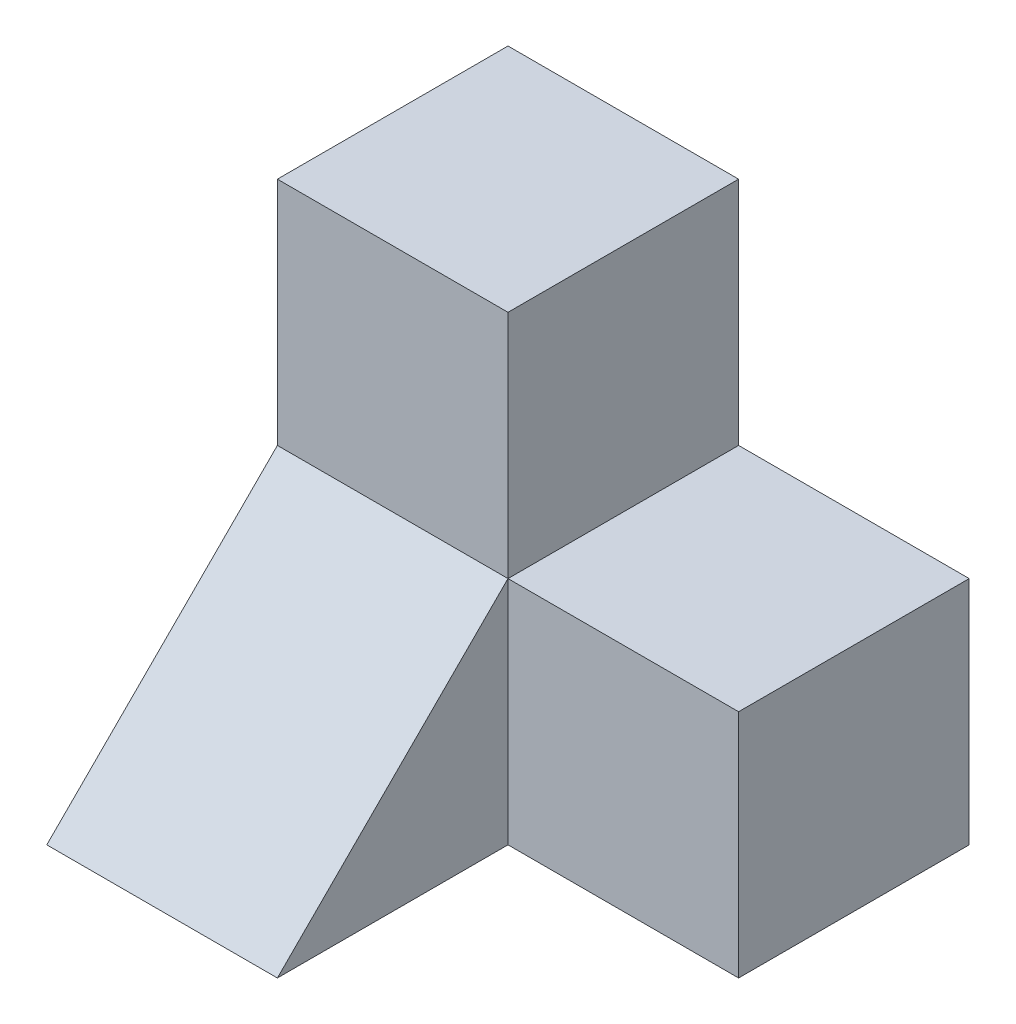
ISO-10303-21;
HEADER;
FILE_DESCRIPTION(('STEP AP214'),'2;1');
FILE_NAME('part.step','',(''),(''),'','','');
FILE_SCHEMA(('AUTOMOTIVE_DESIGN { 1 0 10303 214 1 1 1 1 }'));
ENDSEC;
DATA;
#1=APPLICATION_CONTEXT('core data for automotive mechanical design processes');
#2=APPLICATION_PROTOCOL_DEFINITION('international standard','automotive_design',2000,#1);
#3=PRODUCT_CONTEXT('',#1,'mechanical');
#4=PRODUCT('Part','Part','',(#3));
#5=PRODUCT_RELATED_PRODUCT_CATEGORY('part','',(#4));
#6=PRODUCT_DEFINITION_FORMATION('','',#4);
#7=PRODUCT_DEFINITION_CONTEXT('part definition',#1,'design');
#8=PRODUCT_DEFINITION('design','',#6,#7);
#9=PRODUCT_DEFINITION_SHAPE('','',#8);
#10=(LENGTH_UNIT() NAMED_UNIT(*) SI_UNIT(.MILLI.,.METRE.));
#11=(NAMED_UNIT(*) PLANE_ANGLE_UNIT() SI_UNIT($,.RADIAN.));
#12=(NAMED_UNIT(*) SI_UNIT($,.STERADIAN.) SOLID_ANGLE_UNIT());
#13=UNCERTAINTY_MEASURE_WITH_UNIT(LENGTH_MEASURE(1.E-05),#10,'distance_accuracy_value','');
#14=(GEOMETRIC_REPRESENTATION_CONTEXT(3) GLOBAL_UNCERTAINTY_ASSIGNED_CONTEXT((#13)) GLOBAL_UNIT_ASSIGNED_CONTEXT((#10,
#11,#12)) REPRESENTATION_CONTEXT('',''));
#15=CARTESIAN_POINT('',(0.,0.,0.));
#16=DIRECTION('',(0.,0.,1.));
#17=DIRECTION('',(1.,0.,0.));
#18=AXIS2_PLACEMENT_3D('',#15,#16,#17);
#19=CARTESIAN_POINT('',(0.,0.,10.));
#20=DIRECTION('',(0.,0.,1.));
#21=DIRECTION('',(1.,0.,0.));
#22=AXIS2_PLACEMENT_3D('',#19,#20,#21);
#23=PLANE('',#22);
#24=DIRECTION('',(-1.,0.,0.));
#25=VECTOR('',#24,1.);
#26=CARTESIAN_POINT('',(0.,10.,10.));
#27=LINE('',#26,#25);
#28=CARTESIAN_POINT('',(10.,10.,10.));
#29=VERTEX_POINT('',#28);
#30=CARTESIAN_POINT('',(0.,10.,10.));
#31=VERTEX_POINT('',#30);
#32=EDGE_CURVE('E99',#29,#31,#27,.T.);
#33=ORIENTED_EDGE('',*,*,#32,.F.);
#34=DIRECTION('',(0.,1.,0.));
#35=VECTOR('',#34,1.);
#36=CARTESIAN_POINT('',(10.,10.,10.));
#37=LINE('',#36,#35);
#38=CARTESIAN_POINT('',(10.,20.,10.));
#39=VERTEX_POINT('',#38);
#40=EDGE_CURVE('E139',#29,#39,#37,.T.);
#41=ORIENTED_EDGE('',*,*,#40,.T.);
#42=DIRECTION('',(-1.,0.,0.));
#43=VECTOR('',#42,1.);
#44=CARTESIAN_POINT('',(0.,20.,10.));
#45=LINE('',#44,#43);
#46=CARTESIAN_POINT('',(0.,20.,10.));
#47=VERTEX_POINT('',#46);
#48=EDGE_CURVE('E141',#39,#47,#45,.T.);
#49=ORIENTED_EDGE('',*,*,#48,.T.);
#50=DIRECTION('',(0.,-1.,0.));
#51=VECTOR('',#50,1.);
#52=CARTESIAN_POINT('',(0.,20.,10.));
#53=LINE('',#52,#51);
#54=EDGE_CURVE('E133',#47,#31,#53,.T.);
#55=ORIENTED_EDGE('',*,*,#54,.T.);
#56=EDGE_LOOP('',(#33,#41,#49,#55));
#57=FACE_BOUND('',#56,.T.);
#58=ADVANCED_FACE('F33',(#57),#23,.T.);
#59=CARTESIAN_POINT('',(0.,20.,10.));
#60=DIRECTION('',(1.,0.,0.));
#61=DIRECTION('',(0.,1.,0.));
#62=AXIS2_PLACEMENT_3D('',#59,#60,#61);
#63=PLANE('',#62);
#64=DIRECTION('',(0.,0.,-1.));
#65=VECTOR('',#64,1.);
#66=CARTESIAN_POINT('',(0.,0.,10.));
#67=LINE('',#66,#65);
#68=CARTESIAN_POINT('',(0.,0.,20.));
#69=VERTEX_POINT('',#68);
#70=CARTESIAN_POINT('',(0.,0.,0.));
#71=VERTEX_POINT('',#70);
#72=EDGE_CURVE('E100',#69,#71,#67,.T.);
#73=ORIENTED_EDGE('',*,*,#72,.F.);
#74=DIRECTION('',(0.,-0.707106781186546,0.707106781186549));
#75=VECTOR('',#74,1.);
#76=CARTESIAN_POINT('',(0.,0.,20.));
#77=LINE('',#76,#75);
#78=EDGE_CURVE('E41',#69,#31,#77,.F.);
#79=ORIENTED_EDGE('',*,*,#78,.T.);
#80=ORIENTED_EDGE('',*,*,#54,.F.);
#81=DIRECTION('',(0.,0.,-1.));
#82=VECTOR('',#81,1.);
#83=CARTESIAN_POINT('',(0.,20.,10.));
#84=LINE('',#83,#82);
#85=CARTESIAN_POINT('',(0.,20.,0.));
#86=VERTEX_POINT('',#85);
#87=EDGE_CURVE('E143',#47,#86,#84,.T.);
#88=ORIENTED_EDGE('',*,*,#87,.T.);
#89=DIRECTION('',(0.,-1.,0.));
#90=VECTOR('',#89,1.);
#91=CARTESIAN_POINT('',(0.,20.,0.));
#92=LINE('',#91,#90);
#93=EDGE_CURVE('E107',#86,#71,#92,.T.);
#94=ORIENTED_EDGE('',*,*,#93,.T.);
#95=EDGE_LOOP('',(#73,#79,#80,#88,#94));
#96=FACE_BOUND('',#95,.T.);
#97=ADVANCED_FACE('F104',(#96),#63,.F.);
#98=CARTESIAN_POINT('',(0.,0.,10.));
#99=DIRECTION('',(0.,1.,0.));
#100=DIRECTION('',(0.,0.,1.));
#101=AXIS2_PLACEMENT_3D('',#98,#99,#100);
#102=PLANE('',#101);
#103=DIRECTION('',(1.,0.,0.));
#104=VECTOR('',#103,1.);
#105=CARTESIAN_POINT('',(0.,0.,0.));
#106=LINE('',#105,#104);
#107=CARTESIAN_POINT('',(20.,0.,0.));
#108=VERTEX_POINT('',#107);
#109=EDGE_CURVE('E145',#71,#108,#106,.T.);
#110=ORIENTED_EDGE('',*,*,#109,.T.);
#111=DIRECTION('',(0.,0.,-1.));
#112=VECTOR('',#111,1.);
#113=CARTESIAN_POINT('',(20.,0.,10.));
#114=LINE('',#113,#112);
#115=CARTESIAN_POINT('',(20.,0.,10.));
#116=VERTEX_POINT('',#115);
#117=EDGE_CURVE('E109',#116,#108,#114,.T.);
#118=ORIENTED_EDGE('',*,*,#117,.F.);
#119=DIRECTION('',(1.,0.,0.));
#120=VECTOR('',#119,1.);
#121=CARTESIAN_POINT('',(0.,0.,10.));
#122=LINE('',#121,#120);
#123=CARTESIAN_POINT('',(10.,0.,10.));
#124=VERTEX_POINT('',#123);
#125=EDGE_CURVE('E130',#124,#116,#122,.T.);
#126=ORIENTED_EDGE('',*,*,#125,.F.);
#127=DIRECTION('',(0.,0.,-1.));
#128=VECTOR('',#127,1.);
#129=CARTESIAN_POINT('',(10.,0.,20.));
#130=LINE('',#129,#128);
#131=CARTESIAN_POINT('',(10.,0.,20.));
#132=VERTEX_POINT('',#131);
#133=EDGE_CURVE('E114',#132,#124,#130,.T.);
#134=ORIENTED_EDGE('',*,*,#133,.F.);
#135=DIRECTION('',(1.,0.,0.));
#136=VECTOR('',#135,1.);
#137=CARTESIAN_POINT('',(0.,0.,20.));
#138=LINE('',#137,#136);
#139=EDGE_CURVE('E97',#69,#132,#138,.T.);
#140=ORIENTED_EDGE('',*,*,#139,.F.);
#141=ORIENTED_EDGE('',*,*,#72,.T.);
#142=EDGE_LOOP('',(#110,#118,#126,#134,#140,#141));
#143=FACE_BOUND('',#142,.T.);
#144=ADVANCED_FACE('F112',(#143),#102,.F.);
#145=CARTESIAN_POINT('',(20.,0.,10.));
#146=DIRECTION('',(-1.,0.,0.));
#147=DIRECTION('',(0.,0.,1.));
#148=AXIS2_PLACEMENT_3D('',#145,#146,#147);
#149=PLANE('',#148);
#150=DIRECTION('',(0.,1.,0.));
#151=VECTOR('',#150,1.);
#152=CARTESIAN_POINT('',(20.,0.,0.));
#153=LINE('',#152,#151);
#154=CARTESIAN_POINT('',(20.,10.,0.));
#155=VERTEX_POINT('',#154);
#156=EDGE_CURVE('E147',#108,#155,#153,.T.);
#157=ORIENTED_EDGE('',*,*,#156,.T.);
#158=DIRECTION('',(0.,0.,-1.));
#159=VECTOR('',#158,1.);
#160=CARTESIAN_POINT('',(20.,10.,10.));
#161=LINE('',#160,#159);
#162=CARTESIAN_POINT('',(20.,10.,10.));
#163=VERTEX_POINT('',#162);
#164=EDGE_CURVE('E162',#163,#155,#161,.T.);
#165=ORIENTED_EDGE('',*,*,#164,.F.);
#166=DIRECTION('',(0.,1.,0.));
#167=VECTOR('',#166,1.);
#168=CARTESIAN_POINT('',(20.,0.,10.));
#169=LINE('',#168,#167);
#170=EDGE_CURVE('E132',#116,#163,#169,.T.);
#171=ORIENTED_EDGE('',*,*,#170,.F.);
#172=ORIENTED_EDGE('',*,*,#117,.T.);
#173=EDGE_LOOP('',(#157,#165,#171,#172));
#174=FACE_BOUND('',#173,.T.);
#175=ADVANCED_FACE('F170',(#174),#149,.F.);
#176=CARTESIAN_POINT('',(20.,10.,10.));
#177=DIRECTION('',(0.,-1.,0.));
#178=DIRECTION('',(1.,0.,0.));
#179=AXIS2_PLACEMENT_3D('',#176,#177,#178);
#180=PLANE('',#179);
#181=DIRECTION('',(-1.,0.,0.));
#182=VECTOR('',#181,1.);
#183=CARTESIAN_POINT('',(20.,10.,0.));
#184=LINE('',#183,#182);
#185=CARTESIAN_POINT('',(10.,10.,0.));
#186=VERTEX_POINT('',#185);
#187=EDGE_CURVE('E149',#155,#186,#184,.T.);
#188=ORIENTED_EDGE('',*,*,#187,.T.);
#189=DIRECTION('',(0.,0.,-1.));
#190=VECTOR('',#189,1.);
#191=CARTESIAN_POINT('',(10.,10.,10.));
#192=LINE('',#191,#190);
#193=EDGE_CURVE('E159',#29,#186,#192,.T.);
#194=ORIENTED_EDGE('',*,*,#193,.F.);
#195=DIRECTION('',(-1.,0.,0.));
#196=VECTOR('',#195,1.);
#197=CARTESIAN_POINT('',(20.,10.,10.));
#198=LINE('',#197,#196);
#199=EDGE_CURVE('E137',#163,#29,#198,.T.);
#200=ORIENTED_EDGE('',*,*,#199,.F.);
#201=ORIENTED_EDGE('',*,*,#164,.T.);
#202=EDGE_LOOP('',(#188,#194,#200,#201));
#203=FACE_BOUND('',#202,.T.);
#204=ADVANCED_FACE('F179',(#203),#180,.F.);
#205=CARTESIAN_POINT('',(10.,10.,10.));
#206=DIRECTION('',(-1.,0.,0.));
#207=DIRECTION('',(0.,0.,1.));
#208=AXIS2_PLACEMENT_3D('',#205,#206,#207);
#209=PLANE('',#208);
#210=DIRECTION('',(0.,1.,0.));
#211=VECTOR('',#210,1.);
#212=CARTESIAN_POINT('',(10.,10.,0.));
#213=LINE('',#212,#211);
#214=CARTESIAN_POINT('',(10.,20.,0.));
#215=VERTEX_POINT('',#214);
#216=EDGE_CURVE('E151',#186,#215,#213,.T.);
#217=ORIENTED_EDGE('',*,*,#216,.T.);
#218=DIRECTION('',(0.,0.,-1.));
#219=VECTOR('',#218,1.);
#220=CARTESIAN_POINT('',(10.,20.,10.));
#221=LINE('',#220,#219);
#222=EDGE_CURVE('E156',#39,#215,#221,.T.);
#223=ORIENTED_EDGE('',*,*,#222,.F.);
#224=ORIENTED_EDGE('',*,*,#40,.F.);
#225=ORIENTED_EDGE('',*,*,#193,.T.);
#226=EDGE_LOOP('',(#217,#223,#224,#225));
#227=FACE_BOUND('',#226,.T.);
#228=ADVANCED_FACE('F182',(#227),#209,.F.);
#229=CARTESIAN_POINT('',(0.,20.,10.));
#230=DIRECTION('',(0.,-1.,0.));
#231=DIRECTION('',(0.,0.,-1.));
#232=AXIS2_PLACEMENT_3D('',#229,#230,#231);
#233=PLANE('',#232);
#234=DIRECTION('',(-1.,0.,0.));
#235=VECTOR('',#234,1.);
#236=CARTESIAN_POINT('',(0.,20.,0.));
#237=LINE('',#236,#235);
#238=EDGE_CURVE('E153',#215,#86,#237,.T.);
#239=ORIENTED_EDGE('',*,*,#238,.T.);
#240=ORIENTED_EDGE('',*,*,#87,.F.);
#241=ORIENTED_EDGE('',*,*,#48,.F.);
#242=ORIENTED_EDGE('',*,*,#222,.T.);
#243=EDGE_LOOP('',(#239,#240,#241,#242));
#244=FACE_BOUND('',#243,.T.);
#245=ADVANCED_FACE('F203',(#244),#233,.F.);
#246=DIRECTION('',(0.,1.,0.));
#247=VECTOR('',#246,1.);
#248=CARTESIAN_POINT('',(10.,0.,10.));
#249=LINE('',#248,#247);
#250=EDGE_CURVE('E48',#124,#29,#249,.T.);
#251=ORIENTED_EDGE('',*,*,#250,.F.);
#252=ORIENTED_EDGE('',*,*,#125,.T.);
#253=ORIENTED_EDGE('',*,*,#170,.T.);
#254=ORIENTED_EDGE('',*,*,#199,.T.);
#255=EDGE_LOOP('',(#251,#252,#253,#254));
#256=FACE_BOUND('',#255,.T.);
#257=ADVANCED_FACE('F195',(#256),#23,.T.);
#258=CARTESIAN_POINT('',(0.,0.,0.));
#259=DIRECTION('',(0.,0.,1.));
#260=DIRECTION('',(1.,0.,0.));
#261=AXIS2_PLACEMENT_3D('',#258,#259,#260);
#262=PLANE('',#261);
#263=ORIENTED_EDGE('',*,*,#93,.F.);
#264=ORIENTED_EDGE('',*,*,#238,.F.);
#265=ORIENTED_EDGE('',*,*,#216,.F.);
#266=ORIENTED_EDGE('',*,*,#187,.F.);
#267=ORIENTED_EDGE('',*,*,#156,.F.);
#268=ORIENTED_EDGE('',*,*,#109,.F.);
#269=EDGE_LOOP('',(#263,#264,#265,#266,#267,#268));
#270=FACE_BOUND('',#269,.T.);
#271=ADVANCED_FACE('F174',(#270),#262,.F.);
#272=CARTESIAN_POINT('',(10.,0.,20.));
#273=DIRECTION('',(-1.,0.,0.));
#274=DIRECTION('',(0.,0.,1.));
#275=AXIS2_PLACEMENT_3D('',#272,#273,#274);
#276=PLANE('',#275);
#277=ORIENTED_EDGE('',*,*,#250,.T.);
#278=DIRECTION('',(0.,0.707106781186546,-0.707106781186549));
#279=VECTOR('',#278,1.);
#280=CARTESIAN_POINT('',(10.,0.,20.));
#281=LINE('',#280,#279);
#282=EDGE_CURVE('E11',#29,#132,#281,.F.);
#283=ORIENTED_EDGE('',*,*,#282,.T.);
#284=ORIENTED_EDGE('',*,*,#133,.T.);
#285=EDGE_LOOP('',(#277,#283,#284));
#286=FACE_BOUND('',#285,.T.);
#287=ADVANCED_FACE('F188',(#286),#276,.F.);
#288=CARTESIAN_POINT('',(0.,0.,20.));
#289=DIRECTION('',(0.,-0.707106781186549,-0.707106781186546));
#290=DIRECTION('',(-1.,0.,0.));
#291=AXIS2_PLACEMENT_3D('',#288,#289,#290);
#292=PLANE('',#291);
#293=ORIENTED_EDGE('',*,*,#282,.F.);
#294=ORIENTED_EDGE('',*,*,#32,.T.);
#295=ORIENTED_EDGE('',*,*,#78,.F.);
#296=ORIENTED_EDGE('',*,*,#139,.T.);
#297=EDGE_LOOP('',(#293,#294,#295,#296));
#298=FACE_BOUND('',#297,.T.);
#299=ADVANCED_FACE('F35',(#298),#292,.F.);
#300=CLOSED_SHELL('',(#58,#97,#144,#175,#204,#228,#245,#257,#271,#287,#299));
#301=MANIFOLD_SOLID_BREP('B2',#300);
#302=ADVANCED_BREP_SHAPE_REPRESENTATION('',(#18,#301),#14);
#303=SHAPE_DEFINITION_REPRESENTATION(#9,#302);
ENDSEC;
END-ISO-10303-21;
